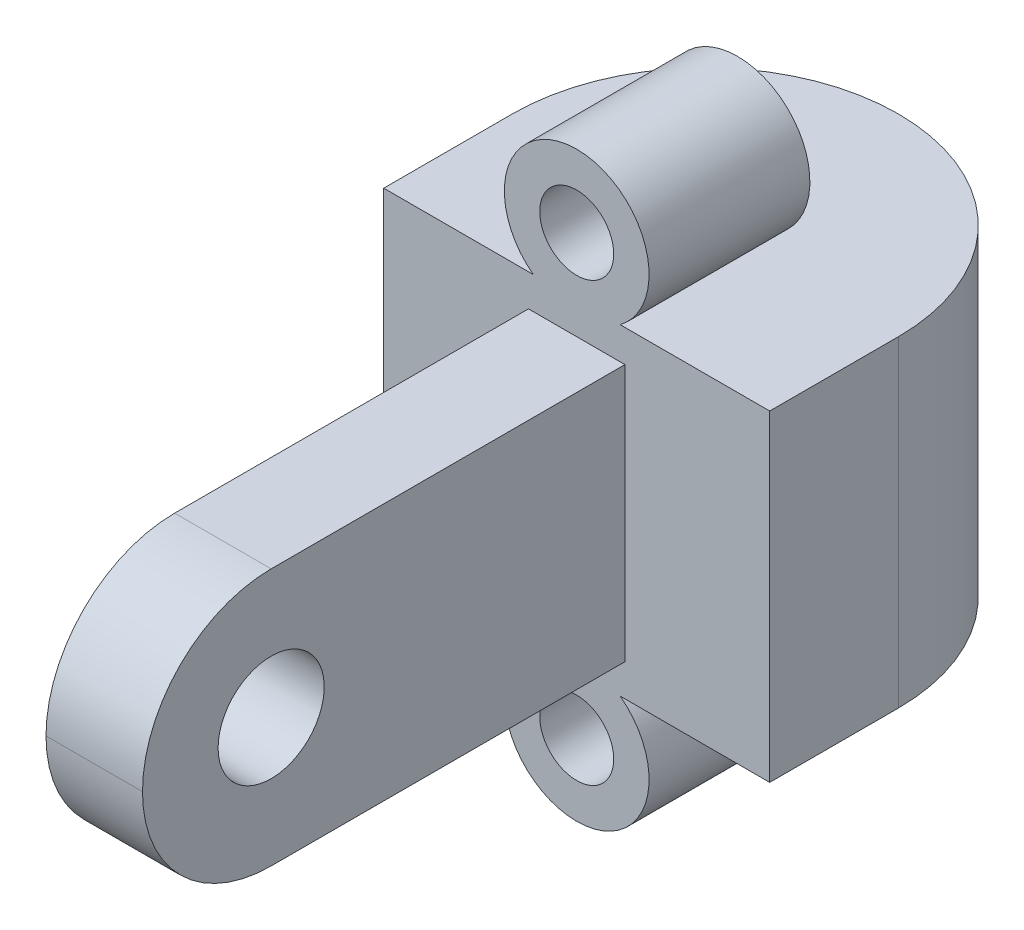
ISO-10303-21;
HEADER;
FILE_DESCRIPTION(('STEP AP214'),'2;1');
FILE_NAME('part.step','',(''),(''),'','','');
FILE_SCHEMA(('AUTOMOTIVE_DESIGN { 1 0 10303 214 1 1 1 1 }'));
ENDSEC;
DATA;
#1=APPLICATION_CONTEXT('core data for automotive mechanical design processes');
#2=APPLICATION_PROTOCOL_DEFINITION('international standard','automotive_design',2000,#1);
#3=PRODUCT_CONTEXT('',#1,'mechanical');
#4=PRODUCT('Part','Part','',(#3));
#5=PRODUCT_RELATED_PRODUCT_CATEGORY('part','',(#4));
#6=PRODUCT_DEFINITION_FORMATION('','',#4);
#7=PRODUCT_DEFINITION_CONTEXT('part definition',#1,'design');
#8=PRODUCT_DEFINITION('design','',#6,#7);
#9=PRODUCT_DEFINITION_SHAPE('','',#8);
#10=(LENGTH_UNIT() NAMED_UNIT(*) SI_UNIT(.MILLI.,.METRE.));
#11=(NAMED_UNIT(*) PLANE_ANGLE_UNIT() SI_UNIT($,.RADIAN.));
#12=(NAMED_UNIT(*) SI_UNIT($,.STERADIAN.) SOLID_ANGLE_UNIT());
#13=UNCERTAINTY_MEASURE_WITH_UNIT(LENGTH_MEASURE(1.E-05),#10,'distance_accuracy_value','');
#14=(GEOMETRIC_REPRESENTATION_CONTEXT(3) GLOBAL_UNCERTAINTY_ASSIGNED_CONTEXT((#13)) GLOBAL_UNIT_ASSIGNED_CONTEXT((#10,
#11,#12)) REPRESENTATION_CONTEXT('',''));
#15=CARTESIAN_POINT('',(0.,0.,0.));
#16=DIRECTION('',(0.,0.,1.));
#17=DIRECTION('',(1.,0.,0.));
#18=AXIS2_PLACEMENT_3D('',#15,#16,#17);
#19=CARTESIAN_POINT('',(4.5,10.,0.));
#20=DIRECTION('',(1.,0.,0.));
#21=DIRECTION('',(0.,0.,-1.));
#22=AXIS2_PLACEMENT_3D('',#19,#20,#21);
#23=PLANE('',#22);
#24=CARTESIAN_POINT('',(4.5,5.,-4.));
#25=DIRECTION('',(-1.,0.,0.));
#26=DIRECTION('',(0.,0.,1.));
#27=AXIS2_PLACEMENT_3D('',#24,#25,#26);
#28=CIRCLE('',#27,1.65);
#29=CARTESIAN_POINT('',(4.5,5.,-2.35));
#30=VERTEX_POINT('',#29);
#31=EDGE_CURVE('E207',#30,#30,#28,.T.);
#32=ORIENTED_EDGE('',*,*,#31,.F.);
#33=EDGE_LOOP('',(#32));
#34=FACE_BOUND('',#33,.T.);
#35=DIRECTION('',(0.,0.,-1.));
#36=VECTOR('',#35,1.);
#37=CARTESIAN_POINT('',(4.5,1.,0.));
#38=LINE('',#37,#36);
#39=CARTESIAN_POINT('',(4.5,1.,-4.));
#40=VERTEX_POINT('',#39);
#41=CARTESIAN_POINT('',(4.5,1.,-15.));
#42=VERTEX_POINT('',#41);
#43=EDGE_CURVE('E206',#40,#42,#38,.T.);
#44=ORIENTED_EDGE('',*,*,#43,.F.);
#45=CARTESIAN_POINT('',(4.5,5.,-4.));
#46=DIRECTION('',(1.,0.,0.));
#47=DIRECTION('',(0.,0.,-1.));
#48=AXIS2_PLACEMENT_3D('',#45,#46,#47);
#49=CIRCLE('',#48,4.);
#50=CARTESIAN_POINT('',(4.5,5.,0.));
#51=VERTEX_POINT('',#50);
#52=EDGE_CURVE('E214',#40,#51,#49,.F.);
#53=ORIENTED_EDGE('',*,*,#52,.T.);
#54=CARTESIAN_POINT('',(4.5,5.,-4.));
#55=DIRECTION('',(1.,0.,0.));
#56=DIRECTION('',(0.,0.,-1.));
#57=AXIS2_PLACEMENT_3D('',#54,#55,#56);
#58=CIRCLE('',#57,4.);
#59=CARTESIAN_POINT('',(4.5,9.,-4.));
#60=VERTEX_POINT('',#59);
#61=EDGE_CURVE('E211',#51,#60,#58,.F.);
#62=ORIENTED_EDGE('',*,*,#61,.T.);
#63=DIRECTION('',(0.,0.,1.));
#64=VECTOR('',#63,1.);
#65=CARTESIAN_POINT('',(4.5,9.,-15.));
#66=LINE('',#65,#64);
#67=CARTESIAN_POINT('',(4.5,9.,-15.));
#68=VERTEX_POINT('',#67);
#69=EDGE_CURVE('E268',#68,#60,#66,.T.);
#70=ORIENTED_EDGE('',*,*,#69,.F.);
#71=DIRECTION('',(0.,-1.,0.));
#72=VECTOR('',#71,1.);
#73=CARTESIAN_POINT('',(4.5,10.,-15.));
#74=LINE('',#73,#72);
#75=EDGE_CURVE('E191',#68,#42,#74,.T.);
#76=ORIENTED_EDGE('',*,*,#75,.T.);
#77=EDGE_LOOP('',(#44,#53,#62,#70,#76));
#78=FACE_BOUND('',#77,.T.);
#79=ADVANCED_FACE('F45',(#34,#78),#23,.F.);
#80=CARTESIAN_POINT('',(7.5,10.,0.));
#81=DIRECTION('',(-1.,0.,0.));
#82=DIRECTION('',(0.,0.,1.));
#83=AXIS2_PLACEMENT_3D('',#80,#81,#82);
#84=PLANE('',#83);
#85=CARTESIAN_POINT('',(7.5,5.,-4.));
#86=DIRECTION('',(-1.,0.,0.));
#87=DIRECTION('',(0.,0.,1.));
#88=AXIS2_PLACEMENT_3D('',#85,#86,#87);
#89=CIRCLE('',#88,1.65);
#90=CARTESIAN_POINT('',(7.5,5.,-2.35));
#91=VERTEX_POINT('',#90);
#92=EDGE_CURVE('E202',#91,#91,#89,.T.);
#93=ORIENTED_EDGE('',*,*,#92,.T.);
#94=EDGE_LOOP('',(#93));
#95=FACE_BOUND('',#94,.T.);
#96=CARTESIAN_POINT('',(7.5,5.,-4.));
#97=DIRECTION('',(-1.,0.,0.));
#98=DIRECTION('',(0.,0.,1.));
#99=AXIS2_PLACEMENT_3D('',#96,#97,#98);
#100=CIRCLE('',#99,4.);
#101=CARTESIAN_POINT('',(7.5,9.,-4.));
#102=VERTEX_POINT('',#101);
#103=CARTESIAN_POINT('',(7.5,5.,0.));
#104=VERTEX_POINT('',#103);
#105=EDGE_CURVE('E217',#102,#104,#100,.F.);
#106=ORIENTED_EDGE('',*,*,#105,.T.);
#107=CARTESIAN_POINT('',(7.5,5.,-4.));
#108=DIRECTION('',(-1.,0.,0.));
#109=DIRECTION('',(0.,0.,1.));
#110=AXIS2_PLACEMENT_3D('',#107,#108,#109);
#111=CIRCLE('',#110,4.);
#112=CARTESIAN_POINT('',(7.5,1.,-4.));
#113=VERTEX_POINT('',#112);
#114=EDGE_CURVE('E220',#104,#113,#111,.F.);
#115=ORIENTED_EDGE('',*,*,#114,.T.);
#116=DIRECTION('',(0.,0.,1.));
#117=VECTOR('',#116,1.);
#118=CARTESIAN_POINT('',(7.5,1.,0.));
#119=LINE('',#118,#117);
#120=CARTESIAN_POINT('',(7.5,1.,-15.));
#121=VERTEX_POINT('',#120);
#122=EDGE_CURVE('E264',#121,#113,#119,.T.);
#123=ORIENTED_EDGE('',*,*,#122,.F.);
#124=DIRECTION('',(0.,-1.,0.));
#125=VECTOR('',#124,1.);
#126=CARTESIAN_POINT('',(7.5,10.,-15.));
#127=LINE('',#126,#125);
#128=CARTESIAN_POINT('',(7.5,9.,-15.));
#129=VERTEX_POINT('',#128);
#130=EDGE_CURVE('E187',#129,#121,#127,.T.);
#131=ORIENTED_EDGE('',*,*,#130,.F.);
#132=DIRECTION('',(0.,0.,-1.));
#133=VECTOR('',#132,1.);
#134=CARTESIAN_POINT('',(7.5,9.,-15.));
#135=LINE('',#134,#133);
#136=EDGE_CURVE('E272',#102,#129,#135,.T.);
#137=ORIENTED_EDGE('',*,*,#136,.F.);
#138=EDGE_LOOP('',(#106,#115,#123,#131,#137));
#139=FACE_BOUND('',#138,.T.);
#140=ADVANCED_FACE('F320',(#95,#139),#84,.F.);
#141=CARTESIAN_POINT('',(6.,10.,-19.));
#142=DIRECTION('',(0.,-1.,0.));
#143=DIRECTION('',(0.,0.,-1.));
#144=AXIS2_PLACEMENT_3D('',#141,#142,#143);
#145=CYLINDRICAL_SURFACE('',#144,6.);
#146=CARTESIAN_POINT('',(6.,0.,-19.));
#147=DIRECTION('',(0.,1.,0.));
#148=DIRECTION('',(0.,0.,1.));
#149=AXIS2_PLACEMENT_3D('',#146,#147,#148);
#150=CIRCLE('',#149,6.);
#151=CARTESIAN_POINT('',(12.,0.,-19.));
#152=VERTEX_POINT('',#151);
#153=CARTESIAN_POINT('',(0.,0.,-19.));
#154=VERTEX_POINT('',#153);
#155=EDGE_CURVE('E278',#152,#154,#150,.T.);
#156=ORIENTED_EDGE('',*,*,#155,.T.);
#157=DIRECTION('',(0.,-1.,0.));
#158=VECTOR('',#157,1.);
#159=CARTESIAN_POINT('',(0.,10.,-19.));
#160=LINE('',#159,#158);
#161=CARTESIAN_POINT('',(0.,10.,-19.));
#162=VERTEX_POINT('',#161);
#163=EDGE_CURVE('E197',#162,#154,#160,.T.);
#164=ORIENTED_EDGE('',*,*,#163,.F.);
#165=CARTESIAN_POINT('',(6.,10.,-19.));
#166=DIRECTION('',(0.,1.,0.));
#167=DIRECTION('',(0.,0.,1.));
#168=AXIS2_PLACEMENT_3D('',#165,#166,#167);
#169=CIRCLE('',#168,6.);
#170=CARTESIAN_POINT('',(12.,10.,-19.));
#171=VERTEX_POINT('',#170);
#172=EDGE_CURVE('E172',#171,#162,#169,.T.);
#173=ORIENTED_EDGE('',*,*,#172,.F.);
#174=DIRECTION('',(0.,-1.,0.));
#175=VECTOR('',#174,1.);
#176=CARTESIAN_POINT('',(12.,10.,-19.));
#177=LINE('',#176,#175);
#178=EDGE_CURVE('E178',#171,#152,#177,.T.);
#179=ORIENTED_EDGE('',*,*,#178,.T.);
#180=EDGE_LOOP('',(#156,#164,#173,#179));
#181=FACE_BOUND('',#180,.T.);
#182=ADVANCED_FACE('F305',(#181),#145,.T.);
#183=CARTESIAN_POINT('',(0.,10.,-15.));
#184=DIRECTION('',(1.,0.,0.));
#185=DIRECTION('',(0.,0.,-1.));
#186=AXIS2_PLACEMENT_3D('',#183,#184,#185);
#187=PLANE('',#186);
#188=DIRECTION('',(0.,0.,1.));
#189=VECTOR('',#188,1.);
#190=CARTESIAN_POINT('',(0.,0.,-15.));
#191=LINE('',#190,#189);
#192=CARTESIAN_POINT('',(0.,0.,-15.));
#193=VERTEX_POINT('',#192);
#194=EDGE_CURVE('E174',#154,#193,#191,.T.);
#195=ORIENTED_EDGE('',*,*,#194,.T.);
#196=DIRECTION('',(0.,-1.,0.));
#197=VECTOR('',#196,1.);
#198=CARTESIAN_POINT('',(0.,10.,-15.));
#199=LINE('',#198,#197);
#200=CARTESIAN_POINT('',(0.,10.,-15.));
#201=VERTEX_POINT('',#200);
#202=EDGE_CURVE('E165',#201,#193,#199,.T.);
#203=ORIENTED_EDGE('',*,*,#202,.F.);
#204=DIRECTION('',(0.,0.,1.));
#205=VECTOR('',#204,1.);
#206=CARTESIAN_POINT('',(0.,10.,-15.));
#207=LINE('',#206,#205);
#208=EDGE_CURVE('E282',#162,#201,#207,.T.);
#209=ORIENTED_EDGE('',*,*,#208,.F.);
#210=ORIENTED_EDGE('',*,*,#163,.T.);
#211=EDGE_LOOP('',(#195,#203,#209,#210));
#212=FACE_BOUND('',#211,.T.);
#213=ADVANCED_FACE('F297',(#212),#187,.F.);
#214=CARTESIAN_POINT('',(12.,10.,-15.));
#215=DIRECTION('',(0.,0.,-1.));
#216=DIRECTION('',(-1.,0.,0.));
#217=AXIS2_PLACEMENT_3D('',#214,#215,#216);
#218=PLANE('',#217);
#219=CARTESIAN_POINT('',(6.,11.8,-15.));
#220=DIRECTION('',(0.,0.,1.));
#221=DIRECTION('',(1.,0.,0.));
#222=AXIS2_PLACEMENT_3D('',#219,#220,#221);
#223=CIRCLE('',#222,1.15);
#224=CARTESIAN_POINT('',(7.15,11.8,-15.));
#225=VERTEX_POINT('',#224);
#226=EDGE_CURVE('E394',#225,#225,#223,.T.);
#227=ORIENTED_EDGE('',*,*,#226,.F.);
#228=EDGE_LOOP('',(#227));
#229=FACE_BOUND('',#228,.T.);
#230=CARTESIAN_POINT('',(6.,-1.8,-15.));
#231=DIRECTION('',(0.,0.,1.));
#232=DIRECTION('',(1.,0.,0.));
#233=AXIS2_PLACEMENT_3D('',#230,#231,#232);
#234=CIRCLE('',#233,1.15);
#235=CARTESIAN_POINT('',(7.15,-1.8,-15.));
#236=VERTEX_POINT('',#235);
#237=EDGE_CURVE('E397',#236,#236,#234,.T.);
#238=ORIENTED_EDGE('',*,*,#237,.F.);
#239=EDGE_LOOP('',(#238));
#240=FACE_BOUND('',#239,.T.);
#241=DIRECTION('',(1.,0.,0.));
#242=VECTOR('',#241,1.);
#243=CARTESIAN_POINT('',(0.,10.,-15.));
#244=LINE('',#243,#242);
#245=CARTESIAN_POINT('',(7.35,10.,-15.));
#246=VERTEX_POINT('',#245);
#247=CARTESIAN_POINT('',(12.,10.,-15.));
#248=VERTEX_POINT('',#247);
#249=EDGE_CURVE('E285',#246,#248,#244,.T.);
#250=ORIENTED_EDGE('',*,*,#249,.F.);
#251=CARTESIAN_POINT('',(6.,11.8,-15.));
#252=DIRECTION('',(0.,0.,1.));
#253=DIRECTION('',(1.,0.,0.));
#254=AXIS2_PLACEMENT_3D('',#251,#252,#253);
#255=CIRCLE('',#254,2.25);
#256=CARTESIAN_POINT('',(4.65,10.,-15.));
#257=VERTEX_POINT('',#256);
#258=EDGE_CURVE('E149',#246,#257,#255,.T.);
#259=ORIENTED_EDGE('',*,*,#258,.T.);
#260=EDGE_CURVE('E286',#201,#257,#244,.T.);
#261=ORIENTED_EDGE('',*,*,#260,.F.);
#262=ORIENTED_EDGE('',*,*,#202,.T.);
#263=DIRECTION('',(1.,0.,0.));
#264=VECTOR('',#263,1.);
#265=CARTESIAN_POINT('',(12.,0.,-15.));
#266=LINE('',#265,#264);
#267=CARTESIAN_POINT('',(4.65,0.,-15.));
#268=VERTEX_POINT('',#267);
#269=EDGE_CURVE('E155',#193,#268,#266,.T.);
#270=ORIENTED_EDGE('',*,*,#269,.T.);
#271=CARTESIAN_POINT('',(6.,-1.8,-15.));
#272=DIRECTION('',(0.,0.,1.));
#273=DIRECTION('',(1.,0.,0.));
#274=AXIS2_PLACEMENT_3D('',#271,#272,#273);
#275=CIRCLE('',#274,2.25);
#276=CARTESIAN_POINT('',(7.35,0.,-15.));
#277=VERTEX_POINT('',#276);
#278=EDGE_CURVE('E137',#268,#277,#275,.T.);
#279=ORIENTED_EDGE('',*,*,#278,.T.);
#280=CARTESIAN_POINT('',(12.,0.,-15.));
#281=VERTEX_POINT('',#280);
#282=EDGE_CURVE('E168',#277,#281,#266,.T.);
#283=ORIENTED_EDGE('',*,*,#282,.T.);
#284=DIRECTION('',(0.,-1.,0.));
#285=VECTOR('',#284,1.);
#286=CARTESIAN_POINT('',(12.,10.,-15.));
#287=LINE('',#286,#285);
#288=EDGE_CURVE('E182',#248,#281,#287,.T.);
#289=ORIENTED_EDGE('',*,*,#288,.F.);
#290=EDGE_LOOP('',(#250,#259,#261,#262,#270,#279,#283,#289));
#291=FACE_BOUND('',#290,.T.);
#292=DIRECTION('',(1.,0.,0.));
#293=VECTOR('',#292,1.);
#294=CARTESIAN_POINT('',(4.5,1.,-15.));
#295=LINE('',#294,#293);
#296=EDGE_CURVE('E261',#42,#121,#295,.T.);
#297=ORIENTED_EDGE('',*,*,#296,.F.);
#298=ORIENTED_EDGE('',*,*,#75,.F.);
#299=DIRECTION('',(-1.,0.,0.));
#300=VECTOR('',#299,1.);
#301=CARTESIAN_POINT('',(4.5,9.,-15.));
#302=LINE('',#301,#300);
#303=EDGE_CURVE('E275',#129,#68,#302,.T.);
#304=ORIENTED_EDGE('',*,*,#303,.F.);
#305=ORIENTED_EDGE('',*,*,#130,.T.);
#306=EDGE_LOOP('',(#297,#298,#304,#305));
#307=FACE_BOUND('',#306,.T.);
#308=ADVANCED_FACE('F161',(#229,#240,#291,#307),#218,.F.);
#309=CARTESIAN_POINT('',(12.,10.,-15.));
#310=DIRECTION('',(-1.,0.,0.));
#311=DIRECTION('',(0.,0.,1.));
#312=AXIS2_PLACEMENT_3D('',#309,#310,#311);
#313=PLANE('',#312);
#314=DIRECTION('',(0.,0.,-1.));
#315=VECTOR('',#314,1.);
#316=CARTESIAN_POINT('',(12.,0.,-15.));
#317=LINE('',#316,#315);
#318=EDGE_CURVE('E167',#281,#152,#317,.T.);
#319=ORIENTED_EDGE('',*,*,#318,.T.);
#320=ORIENTED_EDGE('',*,*,#178,.F.);
#321=DIRECTION('',(0.,0.,-1.));
#322=VECTOR('',#321,1.);
#323=CARTESIAN_POINT('',(12.,10.,-15.));
#324=LINE('',#323,#322);
#325=EDGE_CURVE('E183',#248,#171,#324,.T.);
#326=ORIENTED_EDGE('',*,*,#325,.F.);
#327=ORIENTED_EDGE('',*,*,#288,.T.);
#328=EDGE_LOOP('',(#319,#320,#326,#327));
#329=FACE_BOUND('',#328,.T.);
#330=ADVANCED_FACE('F301',(#329),#313,.F.);
#331=CARTESIAN_POINT('',(6.,10.,-19.));
#332=DIRECTION('',(0.,1.,0.));
#333=DIRECTION('',(0.,0.,1.));
#334=AXIS2_PLACEMENT_3D('',#331,#332,#333);
#335=PLANE('',#334);
#336=DIRECTION('',(0.,0.,1.));
#337=VECTOR('',#336,1.);
#338=CARTESIAN_POINT('',(4.65,10.,-20.));
#339=LINE('',#338,#337);
#340=CARTESIAN_POINT('',(4.65,10.,-20.));
#341=VERTEX_POINT('',#340);
#342=EDGE_CURVE('E11',#341,#257,#339,.T.);
#343=ORIENTED_EDGE('',*,*,#342,.F.);
#344=DIRECTION('',(1.,0.,0.));
#345=VECTOR('',#344,1.);
#346=CARTESIAN_POINT('',(6.,10.,-20.));
#347=LINE('',#346,#345);
#348=CARTESIAN_POINT('',(7.35,10.,-20.));
#349=VERTEX_POINT('',#348);
#350=EDGE_CURVE('E61',#341,#349,#347,.T.);
#351=ORIENTED_EDGE('',*,*,#350,.T.);
#352=DIRECTION('',(0.,0.,1.));
#353=VECTOR('',#352,1.);
#354=CARTESIAN_POINT('',(7.35,10.,-20.));
#355=LINE('',#354,#353);
#356=EDGE_CURVE('E54',#246,#349,#355,.F.);
#357=ORIENTED_EDGE('',*,*,#356,.F.);
#358=ORIENTED_EDGE('',*,*,#249,.T.);
#359=ORIENTED_EDGE('',*,*,#325,.T.);
#360=ORIENTED_EDGE('',*,*,#172,.T.);
#361=ORIENTED_EDGE('',*,*,#208,.T.);
#362=ORIENTED_EDGE('',*,*,#260,.T.);
#363=EDGE_LOOP('',(#343,#351,#357,#358,#359,#360,#361,#362));
#364=FACE_BOUND('',#363,.T.);
#365=ADVANCED_FACE('F306',(#364),#335,.T.);
#366=CARTESIAN_POINT('',(6.,0.,-19.));
#367=DIRECTION('',(0.,1.,0.));
#368=DIRECTION('',(0.,0.,1.));
#369=AXIS2_PLACEMENT_3D('',#366,#367,#368);
#370=PLANE('',#369);
#371=DIRECTION('',(1.,0.,0.));
#372=VECTOR('',#371,1.);
#373=CARTESIAN_POINT('',(6.,0.,-20.));
#374=LINE('',#373,#372);
#375=CARTESIAN_POINT('',(4.65,0.,-20.));
#376=VERTEX_POINT('',#375);
#377=CARTESIAN_POINT('',(7.35,0.,-20.));
#378=VERTEX_POINT('',#377);
#379=EDGE_CURVE('E157',#376,#378,#374,.T.);
#380=ORIENTED_EDGE('',*,*,#379,.F.);
#381=DIRECTION('',(0.,0.,1.));
#382=VECTOR('',#381,1.);
#383=CARTESIAN_POINT('',(4.65,0.,-20.));
#384=LINE('',#383,#382);
#385=EDGE_CURVE('E141',#376,#268,#384,.T.);
#386=ORIENTED_EDGE('',*,*,#385,.T.);
#387=ORIENTED_EDGE('',*,*,#269,.F.);
#388=ORIENTED_EDGE('',*,*,#194,.F.);
#389=ORIENTED_EDGE('',*,*,#155,.F.);
#390=ORIENTED_EDGE('',*,*,#318,.F.);
#391=ORIENTED_EDGE('',*,*,#282,.F.);
#392=DIRECTION('',(0.,0.,1.));
#393=VECTOR('',#392,1.);
#394=CARTESIAN_POINT('',(7.35,0.,-20.));
#395=LINE('',#394,#393);
#396=EDGE_CURVE('E144',#277,#378,#395,.F.);
#397=ORIENTED_EDGE('',*,*,#396,.T.);
#398=EDGE_LOOP('',(#380,#386,#387,#388,#389,#390,#391,#397));
#399=FACE_BOUND('',#398,.T.);
#400=ADVANCED_FACE('F154',(#399),#370,.F.);
#401=CARTESIAN_POINT('',(0.,9.,0.));
#402=DIRECTION('',(0.,1.,0.));
#403=DIRECTION('',(0.,0.,1.));
#404=AXIS2_PLACEMENT_3D('',#401,#402,#403);
#405=PLANE('',#404);
#406=ORIENTED_EDGE('',*,*,#69,.T.);
#407=DIRECTION('',(1.,0.,0.));
#408=VECTOR('',#407,1.);
#409=CARTESIAN_POINT('',(7.5,9.,-4.));
#410=LINE('',#409,#408);
#411=EDGE_CURVE('E223',#60,#102,#410,.T.);
#412=ORIENTED_EDGE('',*,*,#411,.T.);
#413=ORIENTED_EDGE('',*,*,#136,.T.);
#414=ORIENTED_EDGE('',*,*,#303,.T.);
#415=EDGE_LOOP('',(#406,#412,#413,#414));
#416=FACE_BOUND('',#415,.T.);
#417=ADVANCED_FACE('F314',(#416),#405,.T.);
#418=CARTESIAN_POINT('',(0.,1.,0.));
#419=DIRECTION('',(0.,-1.,0.));
#420=DIRECTION('',(0.,0.,-1.));
#421=AXIS2_PLACEMENT_3D('',#418,#419,#420);
#422=PLANE('',#421);
#423=ORIENTED_EDGE('',*,*,#122,.T.);
#424=DIRECTION('',(-1.,0.,0.));
#425=VECTOR('',#424,1.);
#426=CARTESIAN_POINT('',(4.5,1.,-4.));
#427=LINE('',#426,#425);
#428=EDGE_CURVE('E201',#113,#40,#427,.T.);
#429=ORIENTED_EDGE('',*,*,#428,.T.);
#430=ORIENTED_EDGE('',*,*,#43,.T.);
#431=ORIENTED_EDGE('',*,*,#296,.T.);
#432=EDGE_LOOP('',(#423,#429,#430,#431));
#433=FACE_BOUND('',#432,.T.);
#434=ADVANCED_FACE('F355',(#433),#422,.T.);
#435=CARTESIAN_POINT('',(12.,5.,-4.));
#436=DIRECTION('',(-1.,0.,0.));
#437=DIRECTION('',(0.,0.,1.));
#438=AXIS2_PLACEMENT_3D('',#435,#436,#437);
#439=CYLINDRICAL_SURFACE('',#438,1.65);
#440=ORIENTED_EDGE('',*,*,#31,.T.);
#441=EDGE_LOOP('',(#440));
#442=FACE_BOUND('',#441,.T.);
#443=ORIENTED_EDGE('',*,*,#92,.F.);
#444=EDGE_LOOP('',(#443));
#445=FACE_BOUND('',#444,.T.);
#446=ADVANCED_FACE('F344',(#442,#445),#439,.F.);
#447=CARTESIAN_POINT('',(0.,5.,-4.));
#448=DIRECTION('',(-1.,0.,0.));
#449=DIRECTION('',(0.,0.,1.));
#450=AXIS2_PLACEMENT_3D('',#447,#448,#449);
#451=CYLINDRICAL_SURFACE('',#450,4.);
#452=DIRECTION('',(1.,0.,0.));
#453=VECTOR('',#452,1.);
#454=CARTESIAN_POINT('',(4.5,5.,0.));
#455=LINE('',#454,#453);
#456=EDGE_CURVE('E226',#104,#51,#455,.F.);
#457=ORIENTED_EDGE('',*,*,#456,.F.);
#458=ORIENTED_EDGE('',*,*,#105,.F.);
#459=ORIENTED_EDGE('',*,*,#411,.F.);
#460=ORIENTED_EDGE('',*,*,#61,.F.);
#461=EDGE_LOOP('',(#457,#458,#459,#460));
#462=FACE_BOUND('',#461,.T.);
#463=ADVANCED_FACE('F47',(#462),#451,.T.);
#464=CARTESIAN_POINT('',(0.,5.,-4.));
#465=DIRECTION('',(1.,0.,0.));
#466=DIRECTION('',(0.,0.,-1.));
#467=AXIS2_PLACEMENT_3D('',#464,#465,#466);
#468=CYLINDRICAL_SURFACE('',#467,4.);
#469=ORIENTED_EDGE('',*,*,#114,.F.);
#470=ORIENTED_EDGE('',*,*,#456,.T.);
#471=ORIENTED_EDGE('',*,*,#52,.F.);
#472=ORIENTED_EDGE('',*,*,#428,.F.);
#473=EDGE_LOOP('',(#469,#470,#471,#472));
#474=FACE_BOUND('',#473,.T.);
#475=ADVANCED_FACE('F336',(#474),#468,.T.);
#476=CARTESIAN_POINT('',(6.,-1.8,-20.));
#477=DIRECTION('',(0.,0.,1.));
#478=DIRECTION('',(1.,0.,0.));
#479=AXIS2_PLACEMENT_3D('',#476,#477,#478);
#480=CYLINDRICAL_SURFACE('',#479,2.25);
#481=ORIENTED_EDGE('',*,*,#385,.F.);
#482=CARTESIAN_POINT('',(6.,-1.8,-20.));
#483=DIRECTION('',(0.,0.,1.));
#484=DIRECTION('',(1.,0.,0.));
#485=AXIS2_PLACEMENT_3D('',#482,#483,#484);
#486=CIRCLE('',#485,2.25);
#487=EDGE_CURVE('E150',#376,#378,#486,.T.);
#488=ORIENTED_EDGE('',*,*,#487,.T.);
#489=ORIENTED_EDGE('',*,*,#396,.F.);
#490=ORIENTED_EDGE('',*,*,#278,.F.);
#491=EDGE_LOOP('',(#481,#488,#489,#490));
#492=FACE_BOUND('',#491,.T.);
#493=ADVANCED_FACE('F139',(#492),#480,.T.);
#494=CARTESIAN_POINT('',(6.,-1.8,-20.));
#495=DIRECTION('',(0.,0.,1.));
#496=DIRECTION('',(1.,0.,0.));
#497=AXIS2_PLACEMENT_3D('',#494,#495,#496);
#498=PLANE('',#497);
#499=CARTESIAN_POINT('',(6.,-1.8,-20.));
#500=DIRECTION('',(0.,0.,1.));
#501=DIRECTION('',(1.,0.,0.));
#502=AXIS2_PLACEMENT_3D('',#499,#500,#501);
#503=CIRCLE('',#502,1.15);
#504=CARTESIAN_POINT('',(7.15,-1.8,-20.));
#505=VERTEX_POINT('',#504);
#506=EDGE_CURVE('E250',#505,#505,#503,.T.);
#507=ORIENTED_EDGE('',*,*,#506,.T.);
#508=EDGE_LOOP('',(#507));
#509=FACE_BOUND('',#508,.T.);
#510=ORIENTED_EDGE('',*,*,#487,.F.);
#511=ORIENTED_EDGE('',*,*,#379,.T.);
#512=EDGE_LOOP('',(#510,#511));
#513=FACE_BOUND('',#512,.T.);
#514=ADVANCED_FACE('F342',(#509,#513),#498,.F.);
#515=CARTESIAN_POINT('',(6.,11.8,-20.));
#516=DIRECTION('',(0.,0.,1.));
#517=DIRECTION('',(1.,0.,0.));
#518=AXIS2_PLACEMENT_3D('',#515,#516,#517);
#519=CYLINDRICAL_SURFACE('',#518,2.25);
#520=CARTESIAN_POINT('',(6.,11.8,-20.));
#521=DIRECTION('',(0.,0.,1.));
#522=DIRECTION('',(1.,0.,0.));
#523=AXIS2_PLACEMENT_3D('',#520,#521,#522);
#524=CIRCLE('',#523,2.25);
#525=EDGE_CURVE('E230',#349,#341,#524,.T.);
#526=ORIENTED_EDGE('',*,*,#525,.T.);
#527=ORIENTED_EDGE('',*,*,#342,.T.);
#528=ORIENTED_EDGE('',*,*,#258,.F.);
#529=ORIENTED_EDGE('',*,*,#356,.T.);
#530=EDGE_LOOP('',(#526,#527,#528,#529));
#531=FACE_BOUND('',#530,.T.);
#532=ADVANCED_FACE('F241',(#531),#519,.T.);
#533=CARTESIAN_POINT('',(6.,11.8,-20.));
#534=DIRECTION('',(0.,0.,1.));
#535=DIRECTION('',(1.,0.,0.));
#536=AXIS2_PLACEMENT_3D('',#533,#534,#535);
#537=PLANE('',#536);
#538=CARTESIAN_POINT('',(6.,11.8,-20.));
#539=DIRECTION('',(0.,0.,1.));
#540=DIRECTION('',(1.,0.,0.));
#541=AXIS2_PLACEMENT_3D('',#538,#539,#540);
#542=CIRCLE('',#541,1.15);
#543=CARTESIAN_POINT('',(7.15,11.8,-20.));
#544=VERTEX_POINT('',#543);
#545=EDGE_CURVE('E255',#544,#544,#542,.T.);
#546=ORIENTED_EDGE('',*,*,#545,.T.);
#547=EDGE_LOOP('',(#546));
#548=FACE_BOUND('',#547,.T.);
#549=ORIENTED_EDGE('',*,*,#350,.F.);
#550=ORIENTED_EDGE('',*,*,#525,.F.);
#551=EDGE_LOOP('',(#549,#550));
#552=FACE_BOUND('',#551,.T.);
#553=ADVANCED_FACE('F244',(#548,#552),#537,.F.);
#554=CARTESIAN_POINT('',(6.,11.8,-20.));
#555=DIRECTION('',(0.,0.,1.));
#556=DIRECTION('',(1.,0.,0.));
#557=AXIS2_PLACEMENT_3D('',#554,#555,#556);
#558=CYLINDRICAL_SURFACE('',#557,1.15);
#559=ORIENTED_EDGE('',*,*,#545,.F.);
#560=EDGE_LOOP('',(#559));
#561=FACE_BOUND('',#560,.T.);
#562=ORIENTED_EDGE('',*,*,#226,.T.);
#563=EDGE_LOOP('',(#562));
#564=FACE_BOUND('',#563,.T.);
#565=ADVANCED_FACE('F379',(#561,#564),#558,.F.);
#566=CARTESIAN_POINT('',(6.,-1.8,-20.));
#567=DIRECTION('',(0.,0.,1.));
#568=DIRECTION('',(1.,0.,0.));
#569=AXIS2_PLACEMENT_3D('',#566,#567,#568);
#570=CYLINDRICAL_SURFACE('',#569,1.15);
#571=ORIENTED_EDGE('',*,*,#506,.F.);
#572=EDGE_LOOP('',(#571));
#573=FACE_BOUND('',#572,.T.);
#574=ORIENTED_EDGE('',*,*,#237,.T.);
#575=EDGE_LOOP('',(#574));
#576=FACE_BOUND('',#575,.T.);
#577=ADVANCED_FACE('F381',(#573,#576),#570,.F.);
#578=CLOSED_SHELL('',(#79,#140,#182,#213,#308,#330,#365,#400,#417,#434,#446,#463,#475,#493,#514,
#532,#553,#565,#577));
#579=MANIFOLD_SOLID_BREP('B2',#578);
#580=ADVANCED_BREP_SHAPE_REPRESENTATION('',(#18,#579),#14);
#581=SHAPE_DEFINITION_REPRESENTATION(#9,#580);
ENDSEC;
END-ISO-10303-21;
